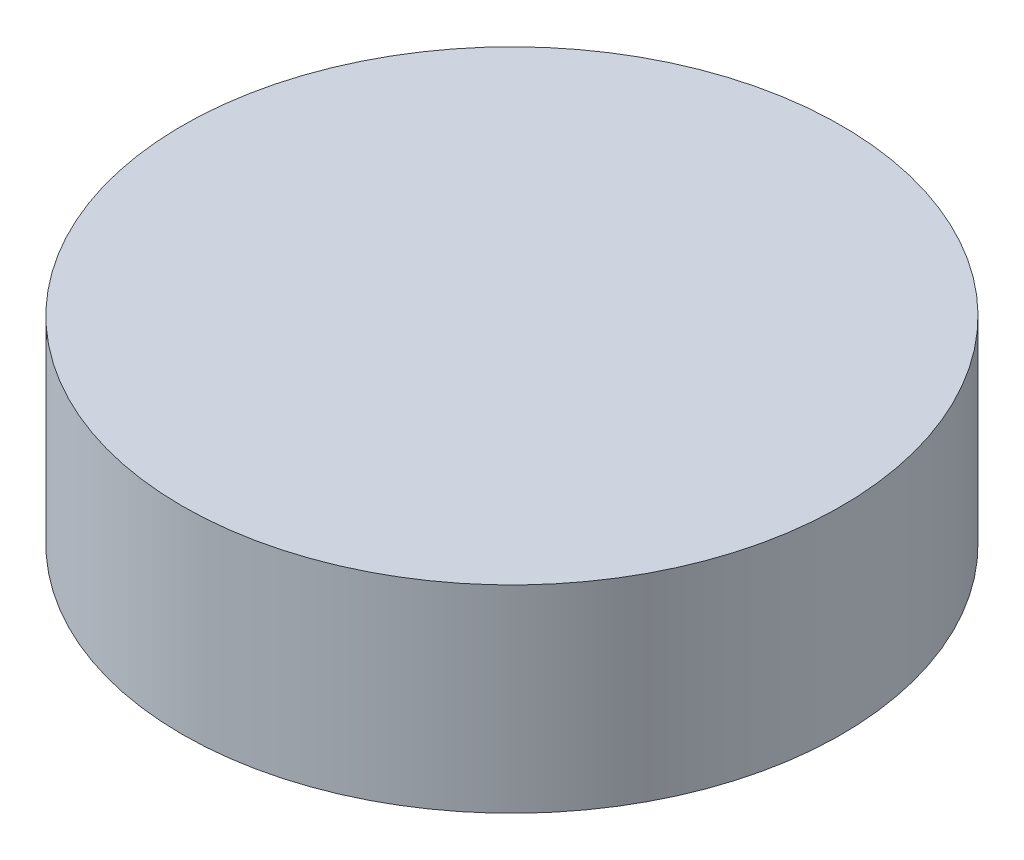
from build123d import *

# Parameters (mm, degrees)
SKETCH1_R      = 50
EXTRUDE1_DEPTH = 30


with BuildPart() as part:
    # Sketch1 → Extrude1 (new body)
    with BuildSketch(Plane(origin=(0, 0, 0), x_dir=(1, 0, 0), z_dir=(0, 1, 0))):
        with Locations(Location((0, 0, 0), (0, 0, 270))):
            Circle(SKETCH1_R)
    extrude(amount=EXTRUDE1_DEPTH)


solid = part.part
